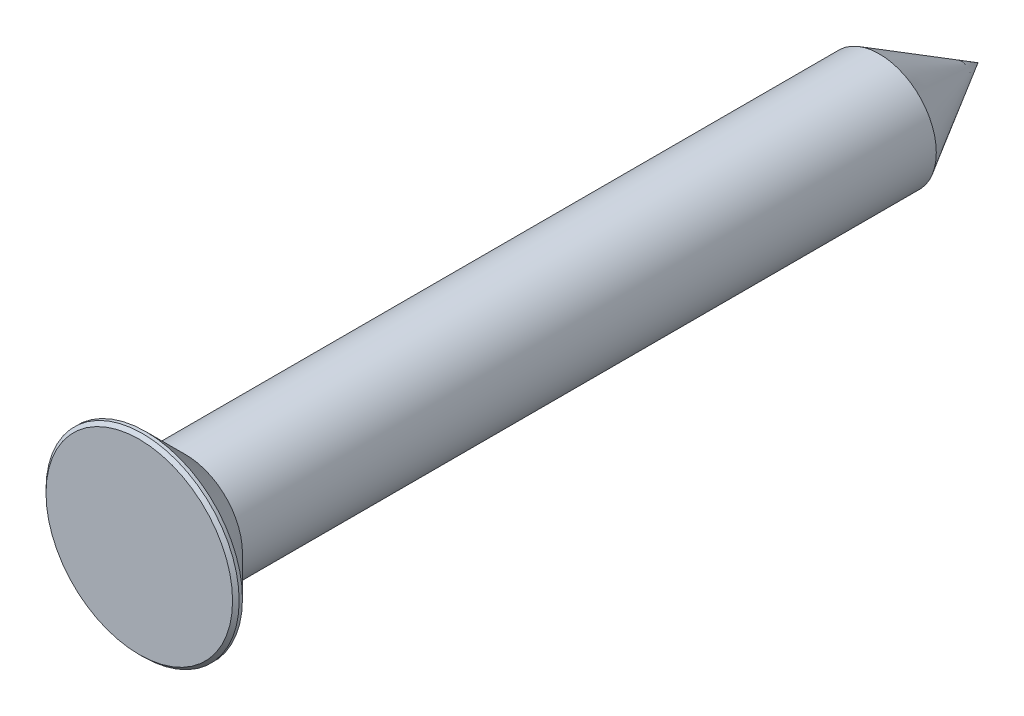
from build123d import *


with BuildPart() as part:
    # Sketch 1 → Revolve 1 (revolve)
    with BuildSketch(Plane(origin=(0, 0, 0), x_dir=(0, 0, -1), z_dir=(1, 0, 0)), mode=Mode.PRIVATE) as revolve_1_sk:
        Polygon((0, 1.4125), (0, 0), (12.7, 0), (11.206106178, 0.8625), (0.7, 0.8625), (0.1, 1.4625), (0.05, 1.4625), align=None)
    revolve(revolve_1_sk.sketch.rotate(Axis((0, 0, 0), (0, 0, -1)), 90), axis=Axis((0, 0, 0), (0, 0, -1)))


solid = part.part
